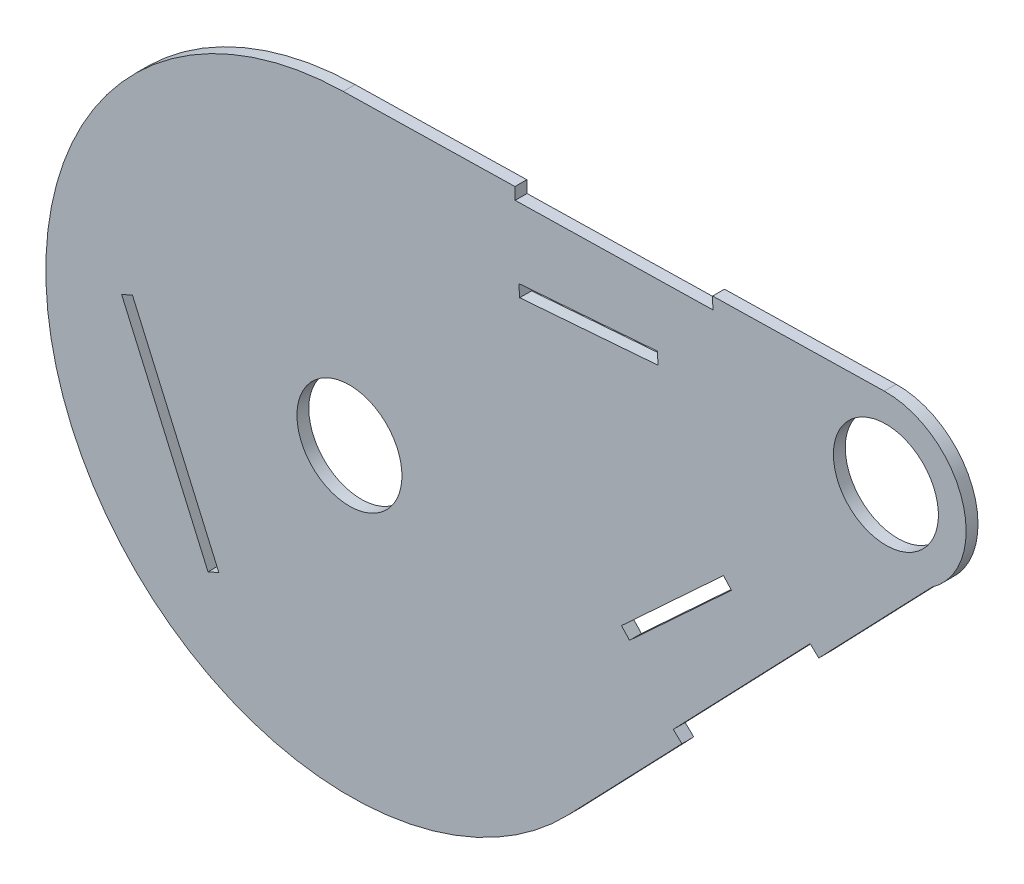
from build123d import *

# Parameters (mm, degrees)
SKETCH1_R           = 6.7437
BOSS_EXTRUDE1_DEPTH = 1.524
CUT_EXTRUDE1_DEPTH  = 1.524


with BuildPart() as part:
    # Sketch1 → Boss-Extrude1 (new body)
    with BuildSketch(Plane.XY):
        with BuildLine():
            Line((15.402470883, -13.334910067), (-31.30492796, -62.017657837))
            ThreePointArc((-31.30492796, -62.017657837), (-95.178118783, -50.675716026), (-60.246096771, 3.988513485))
            Line((-60.246096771, 3.988513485), (9.258899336, 5.401825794))
            ThreePointArc((9.258899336, 5.401825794), (19.264321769, -1.69307822), (15.402470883, -13.334910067))
        make_face()
        with Locations(Location((9.468478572, -4.905028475, 0), (0, 0, 180))):
            Circle(SKETCH1_R, mode=Mode.SUBTRACT)
        with Locations(Location((-59.45306863, -35.011654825, 0), (0, 0, 180))):
            Circle(SKETCH1_R, mode=Mode.SUBTRACT)
        Polygon((-37.582550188, -7.629934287), (-37.700076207, -6.11047266), (-19.907659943, -4.734280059), (-19.790133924, -6.253741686), align=None, mode=Mode.SUBTRACT)
        Polygon((-11.402854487, -25.454307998), (-24.502826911, -37.572670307), (-23.467926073, -38.691400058), (-10.367953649, -26.573037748), align=None, mode=Mode.SUBTRACT)
        Polygon((-88.723379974, -32.829726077), (-77.622261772, -58.148064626), (-76.226531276, -57.536090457), (-87.327649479, -32.217751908), align=None, mode=Mode.SUBTRACT)
    extrude(amount=BOSS_EXTRUDE1_DEPTH)

    # Sketch3 → Cut-Extrude1 (cut)
    with BuildSketch(Plane.XY.offset(1.524)):
        Polygon((0.841178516, -28.51202849), (-0.258532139, -27.456939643), (-17.84334625, -45.785450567), (-16.743635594, -46.840539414), align=None)
        Polygon((-38.190973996, 4.436981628), (-38.159991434, 2.913296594), (-12.765240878, 3.429672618), (-12.79622344, 4.953357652), align=None)
    extrude(amount=-CUT_EXTRUDE1_DEPTH, mode=Mode.SUBTRACT)


solid = part.part
